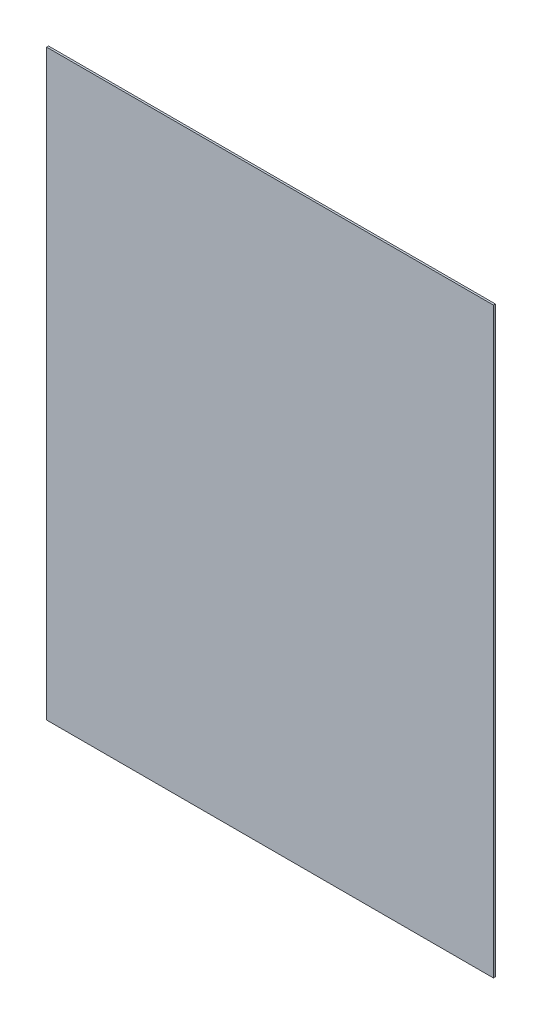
from build123d import *

# Parameters (mm, degrees)
SZKIC1_W                    = 2300
SZKIC1_H                    = 3000
DODANIE_WYCI_GNI_CIE1_DEPTH = 10


with BuildPart() as part:
    # Szkic1 → Dodanie-wyci_gni_cie1 (new body)
    with BuildSketch(Plane.XY):
        with Locations((-210.616848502, -1459.977721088)):
            Rectangle(SZKIC1_W, SZKIC1_H)
    extrude(amount=DODANIE_WYCI_GNI_CIE1_DEPTH)


solid = part.part
